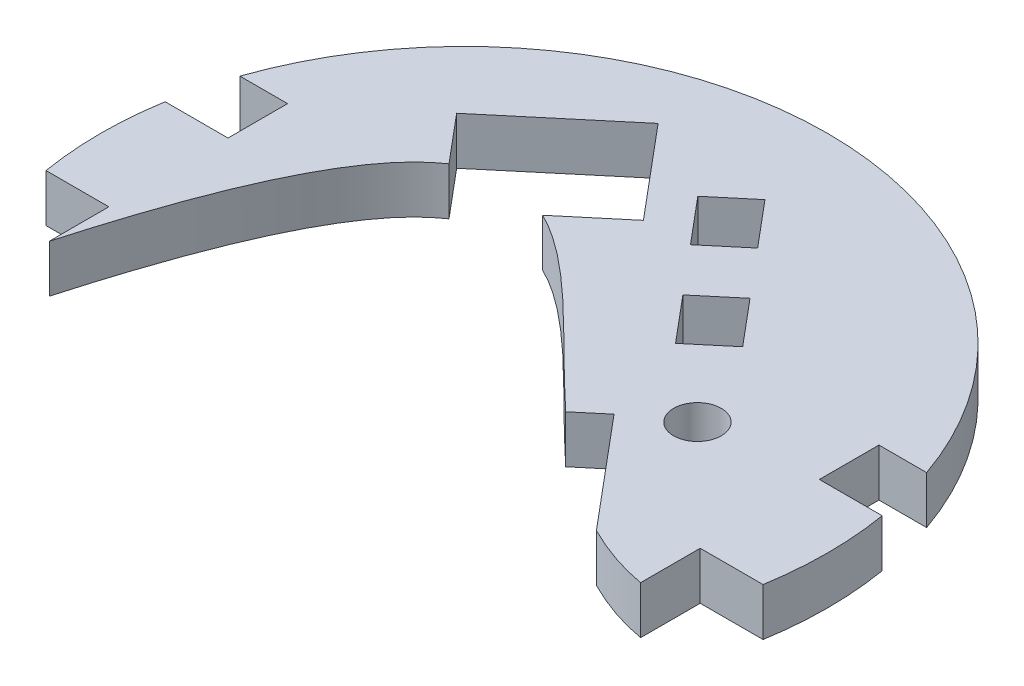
ISO-10303-21;
HEADER;
FILE_DESCRIPTION(('STEP AP214'),'2;1');
FILE_NAME('part.step','',(''),(''),'','','');
FILE_SCHEMA(('AUTOMOTIVE_DESIGN { 1 0 10303 214 1 1 1 1 }'));
ENDSEC;
DATA;
#1=APPLICATION_CONTEXT('core data for automotive mechanical design processes');
#2=APPLICATION_PROTOCOL_DEFINITION('international standard','automotive_design',2000,#1);
#3=PRODUCT_CONTEXT('',#1,'mechanical');
#4=PRODUCT('Part','Part','',(#3));
#5=PRODUCT_RELATED_PRODUCT_CATEGORY('part','',(#4));
#6=PRODUCT_DEFINITION_FORMATION('','',#4);
#7=PRODUCT_DEFINITION_CONTEXT('part definition',#1,'design');
#8=PRODUCT_DEFINITION('design','',#6,#7);
#9=PRODUCT_DEFINITION_SHAPE('','',#8);
#10=(LENGTH_UNIT() NAMED_UNIT(*) SI_UNIT(.MILLI.,.METRE.));
#11=(NAMED_UNIT(*) PLANE_ANGLE_UNIT() SI_UNIT($,.RADIAN.));
#12=(NAMED_UNIT(*) SI_UNIT($,.STERADIAN.) SOLID_ANGLE_UNIT());
#13=UNCERTAINTY_MEASURE_WITH_UNIT(LENGTH_MEASURE(1.E-05),#10,'distance_accuracy_value','');
#14=(GEOMETRIC_REPRESENTATION_CONTEXT(3) GLOBAL_UNCERTAINTY_ASSIGNED_CONTEXT((#13)) GLOBAL_UNIT_ASSIGNED_CONTEXT((#10,
#11,#12)) REPRESENTATION_CONTEXT('',''));
#15=CARTESIAN_POINT('',(0.,0.,0.));
#16=DIRECTION('',(0.,0.,1.));
#17=DIRECTION('',(1.,0.,0.));
#18=AXIS2_PLACEMENT_3D('',#15,#16,#17);
#19=CARTESIAN_POINT('',(0.,4.,0.));
#20=DIRECTION('',(0.,1.,0.));
#21=DIRECTION('',(0.,0.,1.));
#22=AXIS2_PLACEMENT_3D('',#19,#20,#21);
#23=PLANE('',#22);
#24=DIRECTION('',(0.642787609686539,0.,0.766044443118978));
#25=VECTOR('',#24,1.);
#26=CARTESIAN_POINT('',(12.6397333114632,4.,-10.6059955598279));
#27=LINE('',#26,#25);
#28=CARTESIAN_POINT('',(2.19443465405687,4.,-23.0542177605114));
#29=VERTEX_POINT('',#28);
#30=CARTESIAN_POINT('',(5.40837270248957,4.,-19.2239955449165));
#31=VERTEX_POINT('',#30);
#32=EDGE_CURVE('E613',#29,#31,#27,.T.);
#33=ORIENTED_EDGE('',*,*,#32,.T.);
#34=DIRECTION('',(-0.766044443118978,0.,0.64278760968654));
#35=VECTOR('',#34,1.);
#36=CARTESIAN_POINT('',(-7.23136060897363,4.,-8.61799998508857));
#37=LINE('',#36,#35);
#38=CARTESIAN_POINT('',(2.34419493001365,4.,-16.6528451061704));
#39=VERTEX_POINT('',#38);
#40=EDGE_CURVE('E616',#31,#39,#37,.T.);
#41=ORIENTED_EDGE('',*,*,#40,.T.);
#42=DIRECTION('',(0.64278760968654,0.,0.766044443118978));
#43=VECTOR('',#42,1.);
#44=CARTESIAN_POINT('',(9.57555553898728,4.,-8.0348451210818));
#45=LINE('',#44,#43);
#46=CARTESIAN_POINT('',(-0.869743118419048,4.,-20.4830673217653));
#47=VERTEX_POINT('',#46);
#48=EDGE_CURVE('E607',#47,#39,#45,.T.);
#49=ORIENTED_EDGE('',*,*,#48,.F.);
#50=DIRECTION('',(-0.766044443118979,0.,0.642787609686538));
#51=VECTOR('',#50,1.);
#52=CARTESIAN_POINT('',(-10.4452986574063,4.,-12.4482222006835));
#53=LINE('',#52,#51);
#54=EDGE_CURVE('E610',#29,#47,#53,.T.);
#55=ORIENTED_EDGE('',*,*,#54,.F.);
#56=EDGE_LOOP('',(#33,#41,#49,#55));
#57=FACE_BOUND('',#56,.T.);
#58=CARTESIAN_POINT('',(24.8140590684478,4.,10.));
#59=CARTESIAN_POINT('',(2.60810022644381,4.,6.09954088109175));
#60=CARTESIAN_POINT('',(-10.3265066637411,4.,-41.1093024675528));
#61=CARTESIAN_POINT('',(-24.8140590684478,4.,10.));
#62=B_SPLINE_CURVE_WITH_KNOTS('',3,(#58,#59,#60,#61),.UNSPECIFIED.,.F.,.F.,(4,4),(0.,1.),.UNSPECIFIED.);
#63=CARTESIAN_POINT('',(-13.6660144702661,4.,-12.3972122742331));
#64=VERTEX_POINT('',#63);
#65=CARTESIAN_POINT('',(-24.8140590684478,4.,10.));
#66=VERTEX_POINT('',#65);
#67=EDGE_CURVE('E378',#64,#66,#62,.T.);
#68=ORIENTED_EDGE('',*,*,#67,.F.);
#69=DIRECTION('',(-0.64278760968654,0.,-0.766044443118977));
#70=VECTOR('',#69,1.);
#71=CARTESIAN_POINT('',(-1.91511110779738,4.,1.6069690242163));
#72=LINE('',#71,#70);
#73=CARTESIAN_POINT('',(-17.0206199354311,4.,-16.3950753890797));
#74=VERTEX_POINT('',#73);
#75=EDGE_CURVE('E388',#64,#74,#72,.T.);
#76=ORIENTED_EDGE('',*,*,#75,.T.);
#77=DIRECTION('',(-0.766044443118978,0.,0.64278760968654));
#78=VECTOR('',#77,1.);
#79=CARTESIAN_POINT('',(-15.1055088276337,4.,-18.002044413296));
#80=LINE('',#79,#78);
#81=CARTESIAN_POINT('',(-7.82808661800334,4.,-24.1085267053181));
#82=VERTEX_POINT('',#81);
#83=EDGE_CURVE('E644',#82,#74,#80,.T.);
#84=ORIENTED_EDGE('',*,*,#83,.F.);
#85=DIRECTION('',(-0.64278760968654,0.,-0.766044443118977));
#86=VECTOR('',#85,1.);
#87=CARTESIAN_POINT('',(7.27742220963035,4.,-6.10648229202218));
#88=LINE('',#87,#86);
#89=CARTESIAN_POINT('',(-1.40021052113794,4.,-16.4480822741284));
#90=VERTEX_POINT('',#89);
#91=EDGE_CURVE('E647',#90,#82,#88,.T.);
#92=ORIENTED_EDGE('',*,*,#91,.F.);
#93=DIRECTION('',(-0.766044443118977,0.,0.642787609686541));
#94=VECTOR('',#93,1.);
#95=CARTESIAN_POINT('',(-8.67763273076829,4.,-10.3415999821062));
#96=LINE('',#95,#94);
#97=CARTESIAN_POINT('',(-5.996477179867,4.,-12.5913566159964));
#98=VERTEX_POINT('',#97);
#99=EDGE_CURVE('E650',#90,#98,#96,.T.);
#100=ORIENTED_EDGE('',*,*,#99,.T.);
#101=CARTESIAN_POINT('',(9.24867851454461,4.,0.724584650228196));
#102=VERTEX_POINT('',#101);
#103=EDGE_CURVE('E653',#102,#98,#62,.T.);
#104=ORIENTED_EDGE('',*,*,#103,.F.);
#105=DIRECTION('',(-0.766044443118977,0.,0.64278760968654));
#106=VECTOR('',#105,1.);
#107=CARTESIAN_POINT('',(4.17811946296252,4.,4.97928888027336));
#108=LINE('',#107,#106);
#109=CARTESIAN_POINT('',(11.4555416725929,4.,-1.12719341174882));
#110=VERTEX_POINT('',#109);
#111=EDGE_CURVE('E654',#110,#102,#108,.T.);
#112=ORIENTED_EDGE('',*,*,#111,.F.);
#113=DIRECTION('',(0.64278760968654,0.,0.766044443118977));
#114=VECTOR('',#113,1.);
#115=CARTESIAN_POINT('',(7.27742220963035,4.,-6.10648229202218));
#116=LINE('',#115,#114);
#117=CARTESIAN_POINT('',(19.1689929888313,4.,8.0653399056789));
#118=VERTEX_POINT('',#117);
#119=EDGE_CURVE('E657',#110,#118,#116,.T.);
#120=ORIENTED_EDGE('',*,*,#119,.T.);
#121=CARTESIAN_POINT('',(24.8140590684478,4.,10.));
#122=VERTEX_POINT('',#121);
#123=EDGE_CURVE('E660',#122,#118,#62,.T.);
#124=ORIENTED_EDGE('',*,*,#123,.F.);
#125=DIRECTION('',(0.,0.,1.));
#126=VECTOR('',#125,1.);
#127=CARTESIAN_POINT('',(24.8140590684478,4.,0.));
#128=LINE('',#127,#126);
#129=CARTESIAN_POINT('',(24.8140590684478,4.,5.));
#130=VERTEX_POINT('',#129);
#131=EDGE_CURVE('E591',#130,#122,#128,.T.);
#132=ORIENTED_EDGE('',*,*,#131,.F.);
#133=DIRECTION('',(1.,0.,0.));
#134=VECTOR('',#133,1.);
#135=CARTESIAN_POINT('',(0.,4.,5.));
#136=LINE('',#135,#134);
#137=CARTESIAN_POINT('',(30.0873727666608,4.,5.));
#138=VERTEX_POINT('',#137);
#139=EDGE_CURVE('E587',#130,#138,#136,.T.);
#140=ORIENTED_EDGE('',*,*,#139,.T.);
#141=CARTESIAN_POINT('',(0.,4.,0.));
#142=DIRECTION('',(0.,1.,0.));
#143=DIRECTION('',(0.,0.,1.));
#144=AXIS2_PLACEMENT_3D('',#141,#142,#143);
#145=CIRCLE('',#144,30.5);
#146=CARTESIAN_POINT('',(30.0873727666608,4.,-5.));
#147=VERTEX_POINT('',#146);
#148=EDGE_CURVE('E499',#138,#147,#145,.T.);
#149=ORIENTED_EDGE('',*,*,#148,.T.);
#150=DIRECTION('',(1.,0.,0.));
#151=VECTOR('',#150,1.);
#152=CARTESIAN_POINT('',(0.,4.,-5.00000000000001));
#153=LINE('',#152,#151);
#154=CARTESIAN_POINT('',(24.8140590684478,4.,-5.));
#155=VERTEX_POINT('',#154);
#156=EDGE_CURVE('E565',#155,#147,#153,.T.);
#157=ORIENTED_EDGE('',*,*,#156,.F.);
#158=DIRECTION('',(0.,0.,-1.));
#159=VECTOR('',#158,1.);
#160=CARTESIAN_POINT('',(24.8140590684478,4.,0.));
#161=LINE('',#160,#159);
#162=CARTESIAN_POINT('',(24.8140590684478,4.,-10.));
#163=VERTEX_POINT('',#162);
#164=EDGE_CURVE('E569',#155,#163,#161,.T.);
#165=ORIENTED_EDGE('',*,*,#164,.T.);
#166=DIRECTION('',(1.,0.,0.));
#167=VECTOR('',#166,1.);
#168=CARTESIAN_POINT('',(0.,4.,-10.));
#169=LINE('',#168,#167);
#170=CARTESIAN_POINT('',(28.8140590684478,4.,-10.));
#171=VERTEX_POINT('',#170);
#172=EDGE_CURVE('E572',#163,#171,#169,.T.);
#173=ORIENTED_EDGE('',*,*,#172,.T.);
#174=CARTESIAN_POINT('',(-28.8140590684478,4.,-10.));
#175=VERTEX_POINT('',#174);
#176=EDGE_CURVE('E508',#171,#175,#145,.T.);
#177=ORIENTED_EDGE('',*,*,#176,.T.);
#178=DIRECTION('',(-1.,0.,0.));
#179=VECTOR('',#178,1.);
#180=CARTESIAN_POINT('',(0.,4.,-10.));
#181=LINE('',#180,#179);
#182=CARTESIAN_POINT('',(-24.8140590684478,4.,-10.));
#183=VERTEX_POINT('',#182);
#184=EDGE_CURVE('E539',#183,#175,#181,.T.);
#185=ORIENTED_EDGE('',*,*,#184,.F.);
#186=DIRECTION('',(0.,0.,-1.));
#187=VECTOR('',#186,1.);
#188=CARTESIAN_POINT('',(-24.8140590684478,4.,0.));
#189=LINE('',#188,#187);
#190=CARTESIAN_POINT('',(-24.8140590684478,4.,-5.));
#191=VERTEX_POINT('',#190);
#192=EDGE_CURVE('E543',#191,#183,#189,.T.);
#193=ORIENTED_EDGE('',*,*,#192,.F.);
#194=DIRECTION('',(-1.,0.,0.));
#195=VECTOR('',#194,1.);
#196=CARTESIAN_POINT('',(0.,4.,-5.));
#197=LINE('',#196,#195);
#198=CARTESIAN_POINT('',(-30.0873727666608,4.,-5.));
#199=VERTEX_POINT('',#198);
#200=EDGE_CURVE('E546',#191,#199,#197,.T.);
#201=ORIENTED_EDGE('',*,*,#200,.T.);
#202=CARTESIAN_POINT('',(-30.0873727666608,4.,5.));
#203=VERTEX_POINT('',#202);
#204=EDGE_CURVE('E504',#199,#203,#145,.T.);
#205=ORIENTED_EDGE('',*,*,#204,.T.);
#206=DIRECTION('',(-1.,0.,0.));
#207=VECTOR('',#206,1.);
#208=CARTESIAN_POINT('',(0.,4.,5.00000000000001));
#209=LINE('',#208,#207);
#210=CARTESIAN_POINT('',(-24.8140590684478,4.,5.));
#211=VERTEX_POINT('',#210);
#212=EDGE_CURVE('E522',#211,#203,#209,.T.);
#213=ORIENTED_EDGE('',*,*,#212,.F.);
#214=DIRECTION('',(0.,0.,1.));
#215=VECTOR('',#214,1.);
#216=CARTESIAN_POINT('',(-24.8140590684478,4.,0.));
#217=LINE('',#216,#215);
#218=EDGE_CURVE('E518',#211,#66,#217,.T.);
#219=ORIENTED_EDGE('',*,*,#218,.T.);
#220=EDGE_LOOP('',(#68,#76,#84,#92,#100,#104,#112,#120,#124,#132,#140,#149,#157,#165,#173,#177,
#185,#193,#201,#205,#213,#219));
#221=FACE_BOUND('',#220,.T.);
#222=CARTESIAN_POINT('',(15.5268092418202,4.,-4.05386479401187));
#223=DIRECTION('',(0.,1.,0.));
#224=DIRECTION('',(0.,0.,1.));
#225=AXIS2_PLACEMENT_3D('',#222,#223,#224);
#226=CIRCLE('',#225,2.);
#227=CARTESIAN_POINT('',(15.5268092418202,4.,-2.05386479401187));
#228=VERTEX_POINT('',#227);
#229=EDGE_CURVE('E372',#228,#228,#226,.T.);
#230=ORIENTED_EDGE('',*,*,#229,.F.);
#231=EDGE_LOOP('',(#230));
#232=FACE_BOUND('',#231,.T.);
#233=DIRECTION('',(-0.766044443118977,0.,0.642787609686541));
#234=VECTOR('',#233,1.);
#235=CARTESIAN_POINT('',(-3.90227068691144,4.,-4.65054511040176));
#236=LINE('',#235,#234);
#237=CARTESIAN_POINT('',(8.73746262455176,4.,-15.2565406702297));
#238=VERTEX_POINT('',#237);
#239=CARTESIAN_POINT('',(5.67328485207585,4.,-12.6853902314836));
#240=VERTEX_POINT('',#239);
#241=EDGE_CURVE('E360',#238,#240,#236,.T.);
#242=ORIENTED_EDGE('',*,*,#241,.F.);
#243=DIRECTION('',(0.64278760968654,0.,0.766044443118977));
#244=VECTOR('',#243,1.);
#245=CARTESIAN_POINT('',(12.6397333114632,4.,-10.605995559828));
#246=LINE('',#245,#244);
#247=CARTESIAN_POINT('',(11.9514006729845,4.,-11.4263184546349));
#248=VERTEX_POINT('',#247);
#249=EDGE_CURVE('E167',#238,#248,#246,.T.);
#250=ORIENTED_EDGE('',*,*,#249,.T.);
#251=DIRECTION('',(-0.766044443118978,0.,0.64278760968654));
#252=VECTOR('',#251,1.);
#253=CARTESIAN_POINT('',(-0.688332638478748,4.,-0.820322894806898));
#254=LINE('',#253,#252);
#255=CARTESIAN_POINT('',(8.88722290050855,4.,-8.8551680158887));
#256=VERTEX_POINT('',#255);
#257=EDGE_CURVE('E365',#248,#256,#254,.T.);
#258=ORIENTED_EDGE('',*,*,#257,.T.);
#259=DIRECTION('',(0.64278760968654,0.,0.766044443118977));
#260=VECTOR('',#259,1.);
#261=CARTESIAN_POINT('',(9.57555553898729,4.,-8.03484512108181));
#262=LINE('',#261,#260);
#263=EDGE_CURVE('E351',#240,#256,#262,.T.);
#264=ORIENTED_EDGE('',*,*,#263,.F.);
#265=EDGE_LOOP('',(#242,#250,#258,#264));
#266=FACE_BOUND('',#265,.T.);
#267=ADVANCED_FACE('F152',(#57,#221,#232,#266),#23,.T.);
#268=CARTESIAN_POINT('',(0.,0.,0.));
#269=DIRECTION('',(0.,1.,0.));
#270=DIRECTION('',(0.,0.,1.));
#271=AXIS2_PLACEMENT_3D('',#268,#269,#270);
#272=PLANE('',#271);
#273=DIRECTION('',(-0.766044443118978,0.,0.64278760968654));
#274=VECTOR('',#273,1.);
#275=CARTESIAN_POINT('',(-7.23136060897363,0.,-8.61799998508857));
#276=LINE('',#275,#274);
#277=CARTESIAN_POINT('',(5.40837270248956,0.,-19.2239955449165));
#278=VERTEX_POINT('',#277);
#279=CARTESIAN_POINT('',(2.34419493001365,0.,-16.6528451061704));
#280=VERTEX_POINT('',#279);
#281=EDGE_CURVE('E484',#278,#280,#276,.T.);
#282=ORIENTED_EDGE('',*,*,#281,.F.);
#283=DIRECTION('',(0.642787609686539,0.,0.766044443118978));
#284=VECTOR('',#283,1.);
#285=CARTESIAN_POINT('',(12.6397333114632,0.,-10.6059955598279));
#286=LINE('',#285,#284);
#287=CARTESIAN_POINT('',(2.19443465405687,0.,-23.0542177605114));
#288=VERTEX_POINT('',#287);
#289=EDGE_CURVE('E624',#288,#278,#286,.T.);
#290=ORIENTED_EDGE('',*,*,#289,.F.);
#291=DIRECTION('',(-0.766044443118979,0.,0.642787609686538));
#292=VECTOR('',#291,1.);
#293=CARTESIAN_POINT('',(-10.4452986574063,0.,-12.4482222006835));
#294=LINE('',#293,#292);
#295=CARTESIAN_POINT('',(-0.869743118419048,0.,-20.4830673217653));
#296=VERTEX_POINT('',#295);
#297=EDGE_CURVE('E621',#288,#296,#294,.T.);
#298=ORIENTED_EDGE('',*,*,#297,.T.);
#299=DIRECTION('',(0.64278760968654,0.,0.766044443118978));
#300=VECTOR('',#299,1.);
#301=CARTESIAN_POINT('',(9.57555553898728,0.,-8.0348451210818));
#302=LINE('',#301,#300);
#303=EDGE_CURVE('E602',#296,#280,#302,.T.);
#304=ORIENTED_EDGE('',*,*,#303,.T.);
#305=EDGE_LOOP('',(#282,#290,#298,#304));
#306=FACE_BOUND('',#305,.T.);
#307=DIRECTION('',(-0.64278760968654,0.,-0.766044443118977));
#308=VECTOR('',#307,1.);
#309=CARTESIAN_POINT('',(-1.91511110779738,0.,1.6069690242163));
#310=LINE('',#309,#308);
#311=CARTESIAN_POINT('',(-13.6660144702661,0.,-12.3972122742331));
#312=VERTEX_POINT('',#311);
#313=CARTESIAN_POINT('',(-17.0206199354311,0.,-16.3950753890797));
#314=VERTEX_POINT('',#313);
#315=EDGE_CURVE('E488',#312,#314,#310,.T.);
#316=ORIENTED_EDGE('',*,*,#315,.F.);
#317=CARTESIAN_POINT('',(24.8140590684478,0.,10.));
#318=CARTESIAN_POINT('',(2.60810022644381,0.,6.09954088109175));
#319=CARTESIAN_POINT('',(-10.3265066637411,0.,-41.1093024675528));
#320=CARTESIAN_POINT('',(-24.8140590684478,0.,10.));
#321=B_SPLINE_CURVE_WITH_KNOTS('',3,(#317,#318,#319,#320),.UNSPECIFIED.,.F.,.F.,(4,4),(0.,1.),.UNSPECIFIED.);
#322=CARTESIAN_POINT('',(-24.8140590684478,0.,10.));
#323=VERTEX_POINT('',#322);
#324=EDGE_CURVE('E381',#312,#323,#321,.T.);
#325=ORIENTED_EDGE('',*,*,#324,.T.);
#326=DIRECTION('',(0.,0.,1.));
#327=VECTOR('',#326,1.);
#328=CARTESIAN_POINT('',(-24.8140590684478,0.,0.));
#329=LINE('',#328,#327);
#330=CARTESIAN_POINT('',(-24.8140590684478,0.,5.));
#331=VERTEX_POINT('',#330);
#332=EDGE_CURVE('E513',#331,#323,#329,.T.);
#333=ORIENTED_EDGE('',*,*,#332,.F.);
#334=DIRECTION('',(-1.,0.,0.));
#335=VECTOR('',#334,1.);
#336=CARTESIAN_POINT('',(0.,0.,5.00000000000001));
#337=LINE('',#336,#335);
#338=CARTESIAN_POINT('',(-30.0873727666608,0.,5.));
#339=VERTEX_POINT('',#338);
#340=EDGE_CURVE('E521',#331,#339,#337,.T.);
#341=ORIENTED_EDGE('',*,*,#340,.T.);
#342=CARTESIAN_POINT('',(0.,0.,0.));
#343=DIRECTION('',(0.,1.,0.));
#344=DIRECTION('',(0.,0.,1.));
#345=AXIS2_PLACEMENT_3D('',#342,#343,#344);
#346=CIRCLE('',#345,30.5);
#347=CARTESIAN_POINT('',(-30.0873727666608,0.,-5.));
#348=VERTEX_POINT('',#347);
#349=EDGE_CURVE('E506',#348,#339,#346,.T.);
#350=ORIENTED_EDGE('',*,*,#349,.F.);
#351=DIRECTION('',(-1.,0.,0.));
#352=VECTOR('',#351,1.);
#353=CARTESIAN_POINT('',(0.,0.,-5.));
#354=LINE('',#353,#352);
#355=CARTESIAN_POINT('',(-24.8140590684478,0.,-5.));
#356=VERTEX_POINT('',#355);
#357=EDGE_CURVE('E542',#356,#348,#354,.T.);
#358=ORIENTED_EDGE('',*,*,#357,.F.);
#359=DIRECTION('',(0.,0.,-1.));
#360=VECTOR('',#359,1.);
#361=CARTESIAN_POINT('',(-24.8140590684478,0.,0.));
#362=LINE('',#361,#360);
#363=CARTESIAN_POINT('',(-24.8140590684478,0.,-10.));
#364=VERTEX_POINT('',#363);
#365=EDGE_CURVE('E552',#356,#364,#362,.T.);
#366=ORIENTED_EDGE('',*,*,#365,.T.);
#367=DIRECTION('',(-1.,0.,0.));
#368=VECTOR('',#367,1.);
#369=CARTESIAN_POINT('',(0.,0.,-10.));
#370=LINE('',#369,#368);
#371=CARTESIAN_POINT('',(-28.8140590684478,0.,-10.));
#372=VERTEX_POINT('',#371);
#373=EDGE_CURVE('E533',#364,#372,#370,.T.);
#374=ORIENTED_EDGE('',*,*,#373,.T.);
#375=CARTESIAN_POINT('',(28.8140590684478,0.,-10.));
#376=VERTEX_POINT('',#375);
#377=EDGE_CURVE('E505',#376,#372,#346,.T.);
#378=ORIENTED_EDGE('',*,*,#377,.F.);
#379=DIRECTION('',(1.,0.,0.));
#380=VECTOR('',#379,1.);
#381=CARTESIAN_POINT('',(0.,0.,-10.));
#382=LINE('',#381,#380);
#383=CARTESIAN_POINT('',(24.8140590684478,0.,-10.));
#384=VERTEX_POINT('',#383);
#385=EDGE_CURVE('E568',#384,#376,#382,.T.);
#386=ORIENTED_EDGE('',*,*,#385,.F.);
#387=DIRECTION('',(0.,0.,-1.));
#388=VECTOR('',#387,1.);
#389=CARTESIAN_POINT('',(24.8140590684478,0.,0.));
#390=LINE('',#389,#388);
#391=CARTESIAN_POINT('',(24.8140590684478,0.,-5.));
#392=VERTEX_POINT('',#391);
#393=EDGE_CURVE('E578',#392,#384,#390,.T.);
#394=ORIENTED_EDGE('',*,*,#393,.F.);
#395=DIRECTION('',(1.,0.,0.));
#396=VECTOR('',#395,1.);
#397=CARTESIAN_POINT('',(0.,0.,-5.00000000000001));
#398=LINE('',#397,#396);
#399=CARTESIAN_POINT('',(30.0873727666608,0.,-5.));
#400=VERTEX_POINT('',#399);
#401=EDGE_CURVE('E559',#392,#400,#398,.T.);
#402=ORIENTED_EDGE('',*,*,#401,.T.);
#403=CARTESIAN_POINT('',(30.0873727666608,0.,5.));
#404=VERTEX_POINT('',#403);
#405=EDGE_CURVE('E502',#404,#400,#346,.T.);
#406=ORIENTED_EDGE('',*,*,#405,.F.);
#407=DIRECTION('',(1.,0.,0.));
#408=VECTOR('',#407,1.);
#409=CARTESIAN_POINT('',(0.,0.,5.));
#410=LINE('',#409,#408);
#411=CARTESIAN_POINT('',(24.8140590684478,0.,5.));
#412=VERTEX_POINT('',#411);
#413=EDGE_CURVE('E584',#412,#404,#410,.T.);
#414=ORIENTED_EDGE('',*,*,#413,.F.);
#415=DIRECTION('',(0.,0.,1.));
#416=VECTOR('',#415,1.);
#417=CARTESIAN_POINT('',(24.8140590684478,0.,0.));
#418=LINE('',#417,#416);
#419=CARTESIAN_POINT('',(24.8140590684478,0.,10.));
#420=VERTEX_POINT('',#419);
#421=EDGE_CURVE('E590',#412,#420,#418,.T.);
#422=ORIENTED_EDGE('',*,*,#421,.T.);
#423=CARTESIAN_POINT('',(19.1689929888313,0.,8.0653399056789));
#424=VERTEX_POINT('',#423);
#425=EDGE_CURVE('E387',#420,#424,#321,.T.);
#426=ORIENTED_EDGE('',*,*,#425,.T.);
#427=DIRECTION('',(0.64278760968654,0.,0.766044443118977));
#428=VECTOR('',#427,1.);
#429=CARTESIAN_POINT('',(7.27742220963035,0.,-6.10648229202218));
#430=LINE('',#429,#428);
#431=CARTESIAN_POINT('',(11.4555416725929,0.,-1.12719341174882));
#432=VERTEX_POINT('',#431);
#433=EDGE_CURVE('E390',#432,#424,#430,.T.);
#434=ORIENTED_EDGE('',*,*,#433,.F.);
#435=DIRECTION('',(-0.766044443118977,0.,0.64278760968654));
#436=VECTOR('',#435,1.);
#437=CARTESIAN_POINT('',(4.17811946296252,0.,4.97928888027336));
#438=LINE('',#437,#436);
#439=CARTESIAN_POINT('',(9.24867851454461,0.,0.724584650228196));
#440=VERTEX_POINT('',#439);
#441=EDGE_CURVE('E674',#432,#440,#438,.T.);
#442=ORIENTED_EDGE('',*,*,#441,.T.);
#443=CARTESIAN_POINT('',(-5.996477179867,0.,-12.5913566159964));
#444=VERTEX_POINT('',#443);
#445=EDGE_CURVE('E389',#440,#444,#321,.T.);
#446=ORIENTED_EDGE('',*,*,#445,.T.);
#447=DIRECTION('',(-0.766044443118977,0.,0.642787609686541));
#448=VECTOR('',#447,1.);
#449=CARTESIAN_POINT('',(-8.67763273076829,0.,-10.3415999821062));
#450=LINE('',#449,#448);
#451=CARTESIAN_POINT('',(-1.40021052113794,0.,-16.4480822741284));
#452=VERTEX_POINT('',#451);
#453=EDGE_CURVE('E673',#452,#444,#450,.T.);
#454=ORIENTED_EDGE('',*,*,#453,.F.);
#455=DIRECTION('',(-0.64278760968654,0.,-0.766044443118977));
#456=VECTOR('',#455,1.);
#457=CARTESIAN_POINT('',(7.27742220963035,0.,-6.10648229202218));
#458=LINE('',#457,#456);
#459=CARTESIAN_POINT('',(-7.82808661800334,0.,-24.1085267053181));
#460=VERTEX_POINT('',#459);
#461=EDGE_CURVE('E670',#452,#460,#458,.T.);
#462=ORIENTED_EDGE('',*,*,#461,.T.);
#463=DIRECTION('',(-0.766044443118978,0.,0.64278760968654));
#464=VECTOR('',#463,1.);
#465=CARTESIAN_POINT('',(-15.1055088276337,0.,-18.002044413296));
#466=LINE('',#465,#464);
#467=EDGE_CURVE('E668',#460,#314,#466,.T.);
#468=ORIENTED_EDGE('',*,*,#467,.T.);
#469=EDGE_LOOP('',(#316,#325,#333,#341,#350,#358,#366,#374,#378,#386,#394,#402,#406,#414,#422,
#426,#434,#442,#446,#454,#462,#468));
#470=FACE_BOUND('',#469,.T.);
#471=CARTESIAN_POINT('',(15.5268092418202,0.,-4.05386479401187));
#472=DIRECTION('',(0.,1.,0.));
#473=DIRECTION('',(0.,0.,1.));
#474=AXIS2_PLACEMENT_3D('',#471,#472,#473);
#475=CIRCLE('',#474,2.);
#476=CARTESIAN_POINT('',(15.5268092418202,0.,-2.05386479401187));
#477=VERTEX_POINT('',#476);
#478=EDGE_CURVE('E375',#477,#477,#475,.T.);
#479=ORIENTED_EDGE('',*,*,#478,.T.);
#480=EDGE_LOOP('',(#479));
#481=FACE_BOUND('',#480,.T.);
#482=DIRECTION('',(0.64278760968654,0.,0.766044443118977));
#483=VECTOR('',#482,1.);
#484=CARTESIAN_POINT('',(12.6397333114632,0.,-10.605995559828));
#485=LINE('',#484,#483);
#486=CARTESIAN_POINT('',(8.73746262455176,0.,-15.2565406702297));
#487=VERTEX_POINT('',#486);
#488=CARTESIAN_POINT('',(11.9514006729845,0.,-11.4263184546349));
#489=VERTEX_POINT('',#488);
#490=EDGE_CURVE('E12',#487,#489,#485,.T.);
#491=ORIENTED_EDGE('',*,*,#490,.F.);
#492=DIRECTION('',(-0.766044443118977,0.,0.642787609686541));
#493=VECTOR('',#492,1.);
#494=CARTESIAN_POINT('',(-3.90227068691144,0.,-4.65054511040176));
#495=LINE('',#494,#493);
#496=CARTESIAN_POINT('',(5.67328485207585,0.,-12.6853902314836));
#497=VERTEX_POINT('',#496);
#498=EDGE_CURVE('E493',#487,#497,#495,.T.);
#499=ORIENTED_EDGE('',*,*,#498,.T.);
#500=DIRECTION('',(0.64278760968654,0.,0.766044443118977));
#501=VECTOR('',#500,1.);
#502=CARTESIAN_POINT('',(9.57555553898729,0.,-8.03484512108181));
#503=LINE('',#502,#501);
#504=CARTESIAN_POINT('',(8.88722290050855,0.,-8.8551680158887));
#505=VERTEX_POINT('',#504);
#506=EDGE_CURVE('E354',#497,#505,#503,.T.);
#507=ORIENTED_EDGE('',*,*,#506,.T.);
#508=DIRECTION('',(-0.766044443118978,0.,0.64278760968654));
#509=VECTOR('',#508,1.);
#510=CARTESIAN_POINT('',(-0.688332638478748,0.,-0.820322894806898));
#511=LINE('',#510,#509);
#512=EDGE_CURVE('E160',#489,#505,#511,.T.);
#513=ORIENTED_EDGE('',*,*,#512,.F.);
#514=EDGE_LOOP('',(#491,#499,#507,#513));
#515=FACE_BOUND('',#514,.T.);
#516=ADVANCED_FACE('F471',(#306,#470,#481,#515),#272,.F.);
#517=CARTESIAN_POINT('',(0.,4.,0.));
#518=DIRECTION('',(0.,-1.,0.));
#519=DIRECTION('',(0.,0.,-1.));
#520=AXIS2_PLACEMENT_3D('',#517,#518,#519);
#521=CYLINDRICAL_SURFACE('',#520,30.5);
#522=DIRECTION('',(0.,1.,0.));
#523=VECTOR('',#522,1.);
#524=CARTESIAN_POINT('',(30.0873727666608,0.,5.));
#525=LINE('',#524,#523);
#526=EDGE_CURVE('E583',#404,#138,#525,.T.);
#527=ORIENTED_EDGE('',*,*,#526,.F.);
#528=ORIENTED_EDGE('',*,*,#405,.T.);
#529=DIRECTION('',(0.,1.,0.));
#530=VECTOR('',#529,1.);
#531=CARTESIAN_POINT('',(30.0873727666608,0.,-5.));
#532=LINE('',#531,#530);
#533=EDGE_CURVE('E561',#400,#147,#532,.T.);
#534=ORIENTED_EDGE('',*,*,#533,.T.);
#535=ORIENTED_EDGE('',*,*,#148,.F.);
#536=EDGE_LOOP('',(#527,#528,#534,#535));
#537=FACE_BOUND('',#536,.T.);
#538=ADVANCED_FACE('F154',(#537),#521,.T.);
#539=DIRECTION('',(0.,1.,0.));
#540=VECTOR('',#539,1.);
#541=CARTESIAN_POINT('',(28.8140590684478,0.,-10.));
#542=LINE('',#541,#540);
#543=EDGE_CURVE('E549',#376,#171,#542,.T.);
#544=ORIENTED_EDGE('',*,*,#543,.F.);
#545=ORIENTED_EDGE('',*,*,#377,.T.);
#546=DIRECTION('',(0.,1.,0.));
#547=VECTOR('',#546,1.);
#548=CARTESIAN_POINT('',(-28.8140590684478,0.,-10.));
#549=LINE('',#548,#547);
#550=EDGE_CURVE('E535',#372,#175,#549,.T.);
#551=ORIENTED_EDGE('',*,*,#550,.T.);
#552=ORIENTED_EDGE('',*,*,#176,.F.);
#553=EDGE_LOOP('',(#544,#545,#551,#552));
#554=FACE_BOUND('',#553,.T.);
#555=ADVANCED_FACE('F478',(#554),#521,.T.);
#556=DIRECTION('',(0.,1.,0.));
#557=VECTOR('',#556,1.);
#558=CARTESIAN_POINT('',(-30.0873727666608,0.,-5.));
#559=LINE('',#558,#557);
#560=EDGE_CURVE('E525',#348,#199,#559,.T.);
#561=ORIENTED_EDGE('',*,*,#560,.F.);
#562=ORIENTED_EDGE('',*,*,#349,.T.);
#563=DIRECTION('',(0.,1.,0.));
#564=VECTOR('',#563,1.);
#565=CARTESIAN_POINT('',(-30.0873727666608,0.,5.));
#566=LINE('',#565,#564);
#567=EDGE_CURVE('E509',#339,#203,#566,.T.);
#568=ORIENTED_EDGE('',*,*,#567,.T.);
#569=ORIENTED_EDGE('',*,*,#204,.F.);
#570=EDGE_LOOP('',(#561,#562,#568,#569));
#571=FACE_BOUND('',#570,.T.);
#572=ADVANCED_FACE('F468',(#571),#521,.T.);
#573=CARTESIAN_POINT('',(0.,0.,5.00000000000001));
#574=DIRECTION('',(0.,0.,-1.));
#575=DIRECTION('',(-1.,0.,0.));
#576=AXIS2_PLACEMENT_3D('',#573,#574,#575);
#577=PLANE('',#576);
#578=ORIENTED_EDGE('',*,*,#212,.T.);
#579=ORIENTED_EDGE('',*,*,#567,.F.);
#580=ORIENTED_EDGE('',*,*,#340,.F.);
#581=DIRECTION('',(0.,1.,0.));
#582=VECTOR('',#581,1.);
#583=CARTESIAN_POINT('',(-24.8140590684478,0.,5.));
#584=LINE('',#583,#582);
#585=EDGE_CURVE('E516',#331,#211,#584,.T.);
#586=ORIENTED_EDGE('',*,*,#585,.T.);
#587=EDGE_LOOP('',(#578,#579,#580,#586));
#588=FACE_BOUND('',#587,.T.);
#589=ADVANCED_FACE('F464',(#588),#577,.F.);
#590=CARTESIAN_POINT('',(-24.8140590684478,0.,0.));
#591=DIRECTION('',(-1.,0.,0.));
#592=DIRECTION('',(0.,0.,1.));
#593=AXIS2_PLACEMENT_3D('',#590,#591,#592);
#594=PLANE('',#593);
#595=ORIENTED_EDGE('',*,*,#218,.F.);
#596=ORIENTED_EDGE('',*,*,#585,.F.);
#597=ORIENTED_EDGE('',*,*,#332,.T.);
#598=DIRECTION('',(0.,1.,0.));
#599=VECTOR('',#598,1.);
#600=CARTESIAN_POINT('',(-24.8140590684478,0.,10.));
#601=LINE('',#600,#599);
#602=EDGE_CURVE('E512',#323,#66,#601,.T.);
#603=ORIENTED_EDGE('',*,*,#602,.T.);
#604=EDGE_LOOP('',(#595,#596,#597,#603));
#605=FACE_BOUND('',#604,.T.);
#606=ADVANCED_FACE('F460',(#605),#594,.T.);
#607=CARTESIAN_POINT('',(0.,0.,-5.));
#608=DIRECTION('',(0.,0.,-1.));
#609=DIRECTION('',(-1.,0.,0.));
#610=AXIS2_PLACEMENT_3D('',#607,#608,#609);
#611=PLANE('',#610);
#612=ORIENTED_EDGE('',*,*,#200,.F.);
#613=DIRECTION('',(0.,1.,0.));
#614=VECTOR('',#613,1.);
#615=CARTESIAN_POINT('',(-24.8140590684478,0.,-5.));
#616=LINE('',#615,#614);
#617=EDGE_CURVE('E530',#356,#191,#616,.T.);
#618=ORIENTED_EDGE('',*,*,#617,.F.);
#619=ORIENTED_EDGE('',*,*,#357,.T.);
#620=ORIENTED_EDGE('',*,*,#560,.T.);
#621=EDGE_LOOP('',(#612,#618,#619,#620));
#622=FACE_BOUND('',#621,.T.);
#623=ADVANCED_FACE('F453',(#622),#611,.T.);
#624=CARTESIAN_POINT('',(0.,0.,-10.));
#625=DIRECTION('',(0.,0.,-1.));
#626=DIRECTION('',(-1.,0.,0.));
#627=AXIS2_PLACEMENT_3D('',#624,#625,#626);
#628=PLANE('',#627);
#629=ORIENTED_EDGE('',*,*,#184,.T.);
#630=ORIENTED_EDGE('',*,*,#550,.F.);
#631=ORIENTED_EDGE('',*,*,#373,.F.);
#632=DIRECTION('',(0.,1.,0.));
#633=VECTOR('',#632,1.);
#634=CARTESIAN_POINT('',(-24.8140590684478,0.,-10.));
#635=LINE('',#634,#633);
#636=EDGE_CURVE('E532',#364,#183,#635,.T.);
#637=ORIENTED_EDGE('',*,*,#636,.T.);
#638=EDGE_LOOP('',(#629,#630,#631,#637));
#639=FACE_BOUND('',#638,.T.);
#640=ADVANCED_FACE('F450',(#639),#628,.F.);
#641=CARTESIAN_POINT('',(-24.8140590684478,0.,0.));
#642=DIRECTION('',(1.,0.,0.));
#643=DIRECTION('',(0.,0.,-1.));
#644=AXIS2_PLACEMENT_3D('',#641,#642,#643);
#645=PLANE('',#644);
#646=ORIENTED_EDGE('',*,*,#192,.T.);
#647=ORIENTED_EDGE('',*,*,#636,.F.);
#648=ORIENTED_EDGE('',*,*,#365,.F.);
#649=ORIENTED_EDGE('',*,*,#617,.T.);
#650=EDGE_LOOP('',(#646,#647,#648,#649));
#651=FACE_BOUND('',#650,.T.);
#652=ADVANCED_FACE('F448',(#651),#645,.F.);
#653=CARTESIAN_POINT('',(0.,0.,-10.));
#654=DIRECTION('',(0.,0.,1.));
#655=DIRECTION('',(1.,0.,0.));
#656=AXIS2_PLACEMENT_3D('',#653,#654,#655);
#657=PLANE('',#656);
#658=ORIENTED_EDGE('',*,*,#172,.F.);
#659=DIRECTION('',(0.,1.,0.));
#660=VECTOR('',#659,1.);
#661=CARTESIAN_POINT('',(24.8140590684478,0.,-10.));
#662=LINE('',#661,#660);
#663=EDGE_CURVE('E556',#384,#163,#662,.T.);
#664=ORIENTED_EDGE('',*,*,#663,.F.);
#665=ORIENTED_EDGE('',*,*,#385,.T.);
#666=ORIENTED_EDGE('',*,*,#543,.T.);
#667=EDGE_LOOP('',(#658,#664,#665,#666));
#668=FACE_BOUND('',#667,.T.);
#669=ADVANCED_FACE('F441',(#668),#657,.T.);
#670=CARTESIAN_POINT('',(0.,0.,-5.00000000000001));
#671=DIRECTION('',(0.,0.,1.));
#672=DIRECTION('',(1.,0.,0.));
#673=AXIS2_PLACEMENT_3D('',#670,#671,#672);
#674=PLANE('',#673);
#675=ORIENTED_EDGE('',*,*,#156,.T.);
#676=ORIENTED_EDGE('',*,*,#533,.F.);
#677=ORIENTED_EDGE('',*,*,#401,.F.);
#678=DIRECTION('',(0.,1.,0.));
#679=VECTOR('',#678,1.);
#680=CARTESIAN_POINT('',(24.8140590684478,0.,-5.));
#681=LINE('',#680,#679);
#682=EDGE_CURVE('E558',#392,#155,#681,.T.);
#683=ORIENTED_EDGE('',*,*,#682,.T.);
#684=EDGE_LOOP('',(#675,#676,#677,#683));
#685=FACE_BOUND('',#684,.T.);
#686=ADVANCED_FACE('F438',(#685),#674,.F.);
#687=CARTESIAN_POINT('',(24.8140590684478,0.,0.));
#688=DIRECTION('',(1.,0.,0.));
#689=DIRECTION('',(0.,0.,-1.));
#690=AXIS2_PLACEMENT_3D('',#687,#688,#689);
#691=PLANE('',#690);
#692=ORIENTED_EDGE('',*,*,#164,.F.);
#693=ORIENTED_EDGE('',*,*,#682,.F.);
#694=ORIENTED_EDGE('',*,*,#393,.T.);
#695=ORIENTED_EDGE('',*,*,#663,.T.);
#696=EDGE_LOOP('',(#692,#693,#694,#695));
#697=FACE_BOUND('',#696,.T.);
#698=ADVANCED_FACE('F436',(#697),#691,.T.);
#699=CARTESIAN_POINT('',(24.8140590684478,0.,0.));
#700=DIRECTION('',(-1.,0.,0.));
#701=DIRECTION('',(0.,0.,1.));
#702=AXIS2_PLACEMENT_3D('',#699,#700,#701);
#703=PLANE('',#702);
#704=ORIENTED_EDGE('',*,*,#131,.T.);
#705=DIRECTION('',(0.,1.,0.));
#706=VECTOR('',#705,1.);
#707=CARTESIAN_POINT('',(24.8140590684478,0.,10.));
#708=LINE('',#707,#706);
#709=EDGE_CURVE('E581',#420,#122,#708,.T.);
#710=ORIENTED_EDGE('',*,*,#709,.F.);
#711=ORIENTED_EDGE('',*,*,#421,.F.);
#712=DIRECTION('',(0.,1.,0.));
#713=VECTOR('',#712,1.);
#714=CARTESIAN_POINT('',(24.8140590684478,0.,5.));
#715=LINE('',#714,#713);
#716=EDGE_CURVE('E575',#412,#130,#715,.T.);
#717=ORIENTED_EDGE('',*,*,#716,.T.);
#718=EDGE_LOOP('',(#704,#710,#711,#717));
#719=FACE_BOUND('',#718,.T.);
#720=ADVANCED_FACE('F432',(#719),#703,.F.);
#721=CARTESIAN_POINT('',(0.,0.,5.));
#722=DIRECTION('',(0.,0.,1.));
#723=DIRECTION('',(1.,0.,0.));
#724=AXIS2_PLACEMENT_3D('',#721,#722,#723);
#725=PLANE('',#724);
#726=ORIENTED_EDGE('',*,*,#139,.F.);
#727=ORIENTED_EDGE('',*,*,#716,.F.);
#728=ORIENTED_EDGE('',*,*,#413,.T.);
#729=ORIENTED_EDGE('',*,*,#526,.T.);
#730=EDGE_LOOP('',(#726,#727,#728,#729));
#731=FACE_BOUND('',#730,.T.);
#732=ADVANCED_FACE('F428',(#731),#725,.T.);
#733=CARTESIAN_POINT('',(-7.23136060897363,0.,-8.61799998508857));
#734=DIRECTION('',(-0.64278760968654,0.,-0.766044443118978));
#735=DIRECTION('',(-0.766044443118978,0.,0.64278760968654));
#736=AXIS2_PLACEMENT_3D('',#733,#734,#735);
#737=PLANE('',#736);
#738=ORIENTED_EDGE('',*,*,#40,.F.);
#739=DIRECTION('',(0.,1.,0.));
#740=VECTOR('',#739,1.);
#741=CARTESIAN_POINT('',(5.40837270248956,0.,-19.2239955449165));
#742=LINE('',#741,#740);
#743=EDGE_CURVE('E598',#278,#31,#742,.T.);
#744=ORIENTED_EDGE('',*,*,#743,.F.);
#745=ORIENTED_EDGE('',*,*,#281,.T.);
#746=DIRECTION('',(0.,1.,0.));
#747=VECTOR('',#746,1.);
#748=CARTESIAN_POINT('',(2.34419493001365,0.,-16.6528451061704));
#749=LINE('',#748,#747);
#750=EDGE_CURVE('E594',#280,#39,#749,.T.);
#751=ORIENTED_EDGE('',*,*,#750,.T.);
#752=EDGE_LOOP('',(#738,#744,#745,#751));
#753=FACE_BOUND('',#752,.T.);
#754=ADVANCED_FACE('F417',(#753),#737,.T.);
#755=CARTESIAN_POINT('',(9.57555553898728,0.,-8.0348451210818));
#756=DIRECTION('',(-0.766044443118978,0.,0.64278760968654));
#757=DIRECTION('',(0.64278760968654,0.,0.766044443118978));
#758=AXIS2_PLACEMENT_3D('',#755,#756,#757);
#759=PLANE('',#758);
#760=ORIENTED_EDGE('',*,*,#48,.T.);
#761=ORIENTED_EDGE('',*,*,#750,.F.);
#762=ORIENTED_EDGE('',*,*,#303,.F.);
#763=DIRECTION('',(0.,1.,0.));
#764=VECTOR('',#763,1.);
#765=CARTESIAN_POINT('',(-0.869743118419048,0.,-20.4830673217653));
#766=LINE('',#765,#764);
#767=EDGE_CURVE('E604',#296,#47,#766,.T.);
#768=ORIENTED_EDGE('',*,*,#767,.T.);
#769=EDGE_LOOP('',(#760,#761,#762,#768));
#770=FACE_BOUND('',#769,.T.);
#771=ADVANCED_FACE('F413',(#770),#759,.F.);
#772=CARTESIAN_POINT('',(-10.4452986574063,0.,-12.4482222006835));
#773=DIRECTION('',(-0.642787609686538,0.,-0.766044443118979));
#774=DIRECTION('',(-0.766044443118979,0.,0.642787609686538));
#775=AXIS2_PLACEMENT_3D('',#772,#773,#774);
#776=PLANE('',#775);
#777=ORIENTED_EDGE('',*,*,#54,.T.);
#778=ORIENTED_EDGE('',*,*,#767,.F.);
#779=ORIENTED_EDGE('',*,*,#297,.F.);
#780=DIRECTION('',(0.,1.,0.));
#781=VECTOR('',#780,1.);
#782=CARTESIAN_POINT('',(2.19443465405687,0.,-23.0542177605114));
#783=LINE('',#782,#781);
#784=EDGE_CURVE('E601',#288,#29,#783,.T.);
#785=ORIENTED_EDGE('',*,*,#784,.T.);
#786=EDGE_LOOP('',(#777,#778,#779,#785));
#787=FACE_BOUND('',#786,.T.);
#788=ADVANCED_FACE('F416',(#787),#776,.F.);
#789=CARTESIAN_POINT('',(12.6397333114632,0.,-10.6059955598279));
#790=DIRECTION('',(-0.766044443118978,0.,0.642787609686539));
#791=DIRECTION('',(0.642787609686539,0.,0.766044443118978));
#792=AXIS2_PLACEMENT_3D('',#789,#790,#791);
#793=PLANE('',#792);
#794=ORIENTED_EDGE('',*,*,#32,.F.);
#795=ORIENTED_EDGE('',*,*,#784,.F.);
#796=ORIENTED_EDGE('',*,*,#289,.T.);
#797=ORIENTED_EDGE('',*,*,#743,.T.);
#798=EDGE_LOOP('',(#794,#795,#796,#797));
#799=FACE_BOUND('',#798,.T.);
#800=ADVANCED_FACE('F421',(#799),#793,.T.);
#801=DIRECTION('',(0.,1.,0.));
#802=VECTOR('',#801,1.);
#803=SURFACE_OF_LINEAR_EXTRUSION('',#321,#802);
#804=ORIENTED_EDGE('',*,*,#67,.T.);
#805=ORIENTED_EDGE('',*,*,#602,.F.);
#806=ORIENTED_EDGE('',*,*,#324,.F.);
#807=DIRECTION('',(0.,1.,0.));
#808=VECTOR('',#807,1.);
#809=CARTESIAN_POINT('',(-13.6660144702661,0.,-12.3972122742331));
#810=LINE('',#809,#808);
#811=EDGE_CURVE('E619',#312,#64,#810,.T.);
#812=ORIENTED_EDGE('',*,*,#811,.T.);
#813=EDGE_LOOP('',(#804,#805,#806,#812));
#814=FACE_BOUND('',#813,.T.);
#815=ADVANCED_FACE('F403',(#814),#803,.F.);
#816=CARTESIAN_POINT('',(-1.91511110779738,0.,1.6069690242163));
#817=DIRECTION('',(0.766044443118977,0.,-0.64278760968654));
#818=DIRECTION('',(-0.64278760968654,0.,-0.766044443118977));
#819=AXIS2_PLACEMENT_3D('',#816,#817,#818);
#820=PLANE('',#819);
#821=ORIENTED_EDGE('',*,*,#75,.F.);
#822=ORIENTED_EDGE('',*,*,#811,.F.);
#823=ORIENTED_EDGE('',*,*,#315,.T.);
#824=DIRECTION('',(0.,1.,0.));
#825=VECTOR('',#824,1.);
#826=CARTESIAN_POINT('',(-17.0206199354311,0.,-16.3950753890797));
#827=LINE('',#826,#825);
#828=EDGE_CURVE('E639',#314,#74,#827,.T.);
#829=ORIENTED_EDGE('',*,*,#828,.T.);
#830=EDGE_LOOP('',(#821,#822,#823,#829));
#831=FACE_BOUND('',#830,.T.);
#832=ADVANCED_FACE('F713',(#831),#820,.T.);
#833=CARTESIAN_POINT('',(-15.1055088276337,0.,-18.002044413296));
#834=DIRECTION('',(-0.64278760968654,0.,-0.766044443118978));
#835=DIRECTION('',(-0.766044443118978,0.,0.64278760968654));
#836=AXIS2_PLACEMENT_3D('',#833,#834,#835);
#837=PLANE('',#836);
#838=ORIENTED_EDGE('',*,*,#83,.T.);
#839=ORIENTED_EDGE('',*,*,#828,.F.);
#840=ORIENTED_EDGE('',*,*,#467,.F.);
#841=DIRECTION('',(0.,1.,0.));
#842=VECTOR('',#841,1.);
#843=CARTESIAN_POINT('',(-7.82808661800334,0.,-24.1085267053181));
#844=LINE('',#843,#842);
#845=EDGE_CURVE('E637',#460,#82,#844,.T.);
#846=ORIENTED_EDGE('',*,*,#845,.T.);
#847=EDGE_LOOP('',(#838,#839,#840,#846));
#848=FACE_BOUND('',#847,.T.);
#849=ADVANCED_FACE('F710',(#848),#837,.F.);
#850=CARTESIAN_POINT('',(7.27742220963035,0.,-6.10648229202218));
#851=DIRECTION('',(0.766044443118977,0.,-0.64278760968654));
#852=DIRECTION('',(-0.64278760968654,0.,-0.766044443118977));
#853=AXIS2_PLACEMENT_3D('',#850,#851,#852);
#854=PLANE('',#853);
#855=ORIENTED_EDGE('',*,*,#91,.T.);
#856=ORIENTED_EDGE('',*,*,#845,.F.);
#857=ORIENTED_EDGE('',*,*,#461,.F.);
#858=DIRECTION('',(0.,1.,0.));
#859=VECTOR('',#858,1.);
#860=CARTESIAN_POINT('',(-1.40021052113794,0.,-16.4480822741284));
#861=LINE('',#860,#859);
#862=EDGE_CURVE('E635',#452,#90,#861,.T.);
#863=ORIENTED_EDGE('',*,*,#862,.T.);
#864=EDGE_LOOP('',(#855,#856,#857,#863));
#865=FACE_BOUND('',#864,.T.);
#866=ADVANCED_FACE('F707',(#865),#854,.F.);
#867=CARTESIAN_POINT('',(-8.67763273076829,0.,-10.3415999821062));
#868=DIRECTION('',(-0.642787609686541,0.,-0.766044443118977));
#869=DIRECTION('',(-0.766044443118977,0.,0.642787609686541));
#870=AXIS2_PLACEMENT_3D('',#867,#868,#869);
#871=PLANE('',#870);
#872=ORIENTED_EDGE('',*,*,#99,.F.);
#873=ORIENTED_EDGE('',*,*,#862,.F.);
#874=ORIENTED_EDGE('',*,*,#453,.T.);
#875=DIRECTION('',(0.,1.,0.));
#876=VECTOR('',#875,1.);
#877=CARTESIAN_POINT('',(-5.996477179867,0.,-12.5913566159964));
#878=LINE('',#877,#876);
#879=EDGE_CURVE('E633',#444,#98,#878,.T.);
#880=ORIENTED_EDGE('',*,*,#879,.T.);
#881=EDGE_LOOP('',(#872,#873,#874,#880));
#882=FACE_BOUND('',#881,.T.);
#883=ADVANCED_FACE('F401',(#882),#871,.T.);
#884=ORIENTED_EDGE('',*,*,#103,.T.);
#885=ORIENTED_EDGE('',*,*,#879,.F.);
#886=ORIENTED_EDGE('',*,*,#445,.F.);
#887=DIRECTION('',(0.,1.,0.));
#888=VECTOR('',#887,1.);
#889=CARTESIAN_POINT('',(9.24867851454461,0.,0.724584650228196));
#890=LINE('',#889,#888);
#891=EDGE_CURVE('E631',#440,#102,#890,.T.);
#892=ORIENTED_EDGE('',*,*,#891,.T.);
#893=EDGE_LOOP('',(#884,#885,#886,#892));
#894=FACE_BOUND('',#893,.T.);
#895=ADVANCED_FACE('F396',(#894),#803,.F.);
#896=CARTESIAN_POINT('',(4.17811946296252,0.,4.97928888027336));
#897=DIRECTION('',(-0.642787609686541,0.,-0.766044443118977));
#898=DIRECTION('',(-0.766044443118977,0.,0.642787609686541));
#899=AXIS2_PLACEMENT_3D('',#896,#897,#898);
#900=PLANE('',#899);
#901=ORIENTED_EDGE('',*,*,#111,.T.);
#902=ORIENTED_EDGE('',*,*,#891,.F.);
#903=ORIENTED_EDGE('',*,*,#441,.F.);
#904=DIRECTION('',(0.,1.,0.));
#905=VECTOR('',#904,1.);
#906=CARTESIAN_POINT('',(11.4555416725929,0.,-1.12719341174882));
#907=LINE('',#906,#905);
#908=EDGE_CURVE('E629',#432,#110,#907,.T.);
#909=ORIENTED_EDGE('',*,*,#908,.T.);
#910=EDGE_LOOP('',(#901,#902,#903,#909));
#911=FACE_BOUND('',#910,.T.);
#912=ADVANCED_FACE('F400',(#911),#900,.F.);
#913=CARTESIAN_POINT('',(7.27742220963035,0.,-6.10648229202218));
#914=DIRECTION('',(-0.766044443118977,0.,0.64278760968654));
#915=DIRECTION('',(0.64278760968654,0.,0.766044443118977));
#916=AXIS2_PLACEMENT_3D('',#913,#914,#915);
#917=PLANE('',#916);
#918=ORIENTED_EDGE('',*,*,#119,.F.);
#919=ORIENTED_EDGE('',*,*,#908,.F.);
#920=ORIENTED_EDGE('',*,*,#433,.T.);
#921=DIRECTION('',(0.,1.,0.));
#922=VECTOR('',#921,1.);
#923=CARTESIAN_POINT('',(19.1689929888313,0.,8.0653399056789));
#924=LINE('',#923,#922);
#925=EDGE_CURVE('E627',#424,#118,#924,.T.);
#926=ORIENTED_EDGE('',*,*,#925,.T.);
#927=EDGE_LOOP('',(#918,#919,#920,#926));
#928=FACE_BOUND('',#927,.T.);
#929=ADVANCED_FACE('F408',(#928),#917,.T.);
#930=ORIENTED_EDGE('',*,*,#123,.T.);
#931=ORIENTED_EDGE('',*,*,#925,.F.);
#932=ORIENTED_EDGE('',*,*,#425,.F.);
#933=ORIENTED_EDGE('',*,*,#709,.T.);
#934=EDGE_LOOP('',(#930,#931,#932,#933));
#935=FACE_BOUND('',#934,.T.);
#936=ADVANCED_FACE('F404',(#935),#803,.F.);
#937=CARTESIAN_POINT('',(15.5268092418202,0.,-4.05386479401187));
#938=DIRECTION('',(0.,1.,0.));
#939=DIRECTION('',(0.,0.,1.));
#940=AXIS2_PLACEMENT_3D('',#937,#938,#939);
#941=CYLINDRICAL_SURFACE('',#940,2.);
#942=ORIENTED_EDGE('',*,*,#478,.F.);
#943=EDGE_LOOP('',(#942));
#944=FACE_BOUND('',#943,.T.);
#945=ORIENTED_EDGE('',*,*,#229,.T.);
#946=EDGE_LOOP('',(#945));
#947=FACE_BOUND('',#946,.T.);
#948=ADVANCED_FACE('F893',(#944,#947),#941,.F.);
#949=CARTESIAN_POINT('',(12.6397333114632,-6.,-10.605995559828));
#950=DIRECTION('',(-0.766044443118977,0.,0.64278760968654));
#951=DIRECTION('',(0.64278760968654,0.,0.766044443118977));
#952=AXIS2_PLACEMENT_3D('',#949,#950,#951);
#953=PLANE('',#952);
#954=ORIENTED_EDGE('',*,*,#490,.T.);
#955=DIRECTION('',(0.,1.,0.));
#956=VECTOR('',#955,1.);
#957=CARTESIAN_POINT('',(11.9514006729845,-6.,-11.4263184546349));
#958=LINE('',#957,#956);
#959=EDGE_CURVE('E370',#489,#248,#958,.T.);
#960=ORIENTED_EDGE('',*,*,#959,.T.);
#961=ORIENTED_EDGE('',*,*,#249,.F.);
#962=DIRECTION('',(0.,1.,0.));
#963=VECTOR('',#962,1.);
#964=CARTESIAN_POINT('',(8.73746262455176,-6.,-15.2565406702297));
#965=LINE('',#964,#963);
#966=EDGE_CURVE('E357',#487,#238,#965,.T.);
#967=ORIENTED_EDGE('',*,*,#966,.F.);
#968=EDGE_LOOP('',(#954,#960,#961,#967));
#969=FACE_BOUND('',#968,.T.);
#970=ADVANCED_FACE('F495',(#969),#953,.T.);
#971=CARTESIAN_POINT('',(-0.688332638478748,-6.,-0.820322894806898));
#972=DIRECTION('',(-0.64278760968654,0.,-0.766044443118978));
#973=DIRECTION('',(-0.766044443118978,0.,0.64278760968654));
#974=AXIS2_PLACEMENT_3D('',#971,#972,#973);
#975=PLANE('',#974);
#976=ORIENTED_EDGE('',*,*,#512,.T.);
#977=DIRECTION('',(0.,1.,0.));
#978=VECTOR('',#977,1.);
#979=CARTESIAN_POINT('',(8.88722290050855,-6.,-8.8551680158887));
#980=LINE('',#979,#978);
#981=EDGE_CURVE('E356',#505,#256,#980,.T.);
#982=ORIENTED_EDGE('',*,*,#981,.T.);
#983=ORIENTED_EDGE('',*,*,#257,.F.);
#984=ORIENTED_EDGE('',*,*,#959,.F.);
#985=EDGE_LOOP('',(#976,#982,#983,#984));
#986=FACE_BOUND('',#985,.T.);
#987=ADVANCED_FACE('F497',(#986),#975,.T.);
#988=CARTESIAN_POINT('',(9.57555553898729,-6.,-8.03484512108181));
#989=DIRECTION('',(-0.766044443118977,0.,0.64278760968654));
#990=DIRECTION('',(0.64278760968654,0.,0.766044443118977));
#991=AXIS2_PLACEMENT_3D('',#988,#989,#990);
#992=PLANE('',#991);
#993=DIRECTION('',(0.,1.,0.));
#994=VECTOR('',#993,1.);
#995=CARTESIAN_POINT('',(5.67328485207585,-6.,-12.6853902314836));
#996=LINE('',#995,#994);
#997=EDGE_CURVE('E175',#497,#240,#996,.T.);
#998=ORIENTED_EDGE('',*,*,#997,.T.);
#999=ORIENTED_EDGE('',*,*,#263,.T.);
#1000=ORIENTED_EDGE('',*,*,#981,.F.);
#1001=ORIENTED_EDGE('',*,*,#506,.F.);
#1002=EDGE_LOOP('',(#998,#999,#1000,#1001));
#1003=FACE_BOUND('',#1002,.T.);
#1004=ADVANCED_FACE('F348',(#1003),#992,.F.);
#1005=CARTESIAN_POINT('',(-3.90227068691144,-6.,-4.65054511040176));
#1006=DIRECTION('',(-0.642787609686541,0.,-0.766044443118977));
#1007=DIRECTION('',(-0.766044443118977,0.,0.642787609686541));
#1008=AXIS2_PLACEMENT_3D('',#1005,#1006,#1007);
#1009=PLANE('',#1008);
#1010=ORIENTED_EDGE('',*,*,#966,.T.);
#1011=ORIENTED_EDGE('',*,*,#241,.T.);
#1012=ORIENTED_EDGE('',*,*,#997,.F.);
#1013=ORIENTED_EDGE('',*,*,#498,.F.);
#1014=EDGE_LOOP('',(#1010,#1011,#1012,#1013));
#1015=FACE_BOUND('',#1014,.T.);
#1016=ADVANCED_FACE('F361',(#1015),#1009,.F.);
#1017=CLOSED_SHELL('',(#267,#516,#538,#555,#572,#589,#606,#623,#640,#652,#669,#686,#698,#720,
#732,#754,#771,#788,#800,#815,#832,#849,#866,#883,#895,#912,#929,#936,#948,#970,#987,#1004,#1016));
#1018=MANIFOLD_SOLID_BREP('B2',#1017);
#1019=ADVANCED_BREP_SHAPE_REPRESENTATION('',(#18,#1018),#14);
#1020=SHAPE_DEFINITION_REPRESENTATION(#9,#1019);
ENDSEC;
END-ISO-10303-21;
